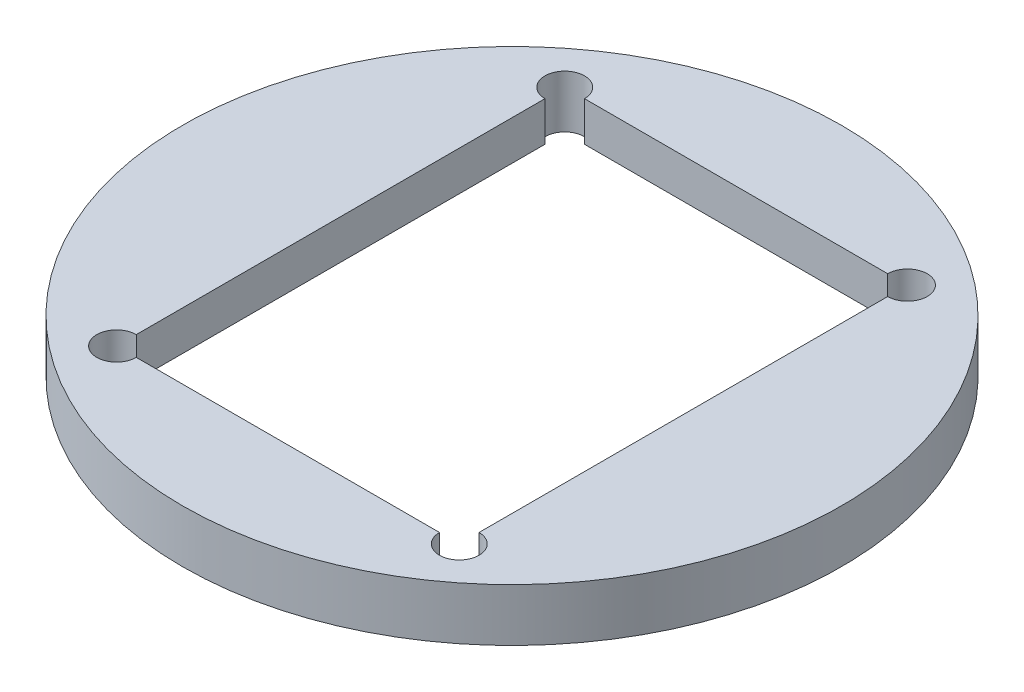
from build123d import *

# Parameters (mm, degrees)
SKETCH1_R           = 3.175
SKETCH1_W           = 3.302
SKETCH1_H           = 4.318
BOSS_EXTRUDE1_DEPTH = 0.508
CHAMFER1_SIZE       = 0.127
SKETCH2_R           = 0.1905
CUT_EXTRUDE1_DEPTH  = 5.518773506


with BuildPart() as part:
    # Sketch1 → Boss-Extrude1 (new body)
    with BuildSketch(Plane(origin=(0, 0, 0), x_dir=(1, 0, 0), z_dir=(0, 1, 0))):
        with Locations(Location((0, 0, 0), (0, 0, 270))):
            Circle(SKETCH1_R)
        Rectangle(SKETCH1_W, SKETCH1_H, mode=Mode.SUBTRACT)
    extrude(amount=BOSS_EXTRUDE1_DEPTH)

    # Chamfer1
    chamfer1_edges = [part.edges().sort_by_distance(p)[0] for p in [
        (-1.651, 0, 0),
        (0, 0, 2.159),
        (1.651, 0, 0),
        (0, 0, -2.159),
    ]]
    chamfer(chamfer1_edges, length=CHAMFER1_SIZE)

    # Sketch2 → Cut-Extrude1 (cut, through all)
    with BuildSketch(Plane(origin=(0, 0.508, 0), x_dir=(1, 0, 0), z_dir=(0, 1, 0))):
        with Locations((1.651, -2.159)):
            Circle(SKETCH2_R)
        with Locations((-1.651, -2.159)):
            Circle(SKETCH2_R)
        with Locations((-1.651, 2.159)):
            Circle(SKETCH2_R)
        with Locations((1.651, 2.159)):
            Circle(SKETCH2_R)
    extrude(amount=-CUT_EXTRUDE1_DEPTH, mode=Mode.SUBTRACT)


solid = part.part
